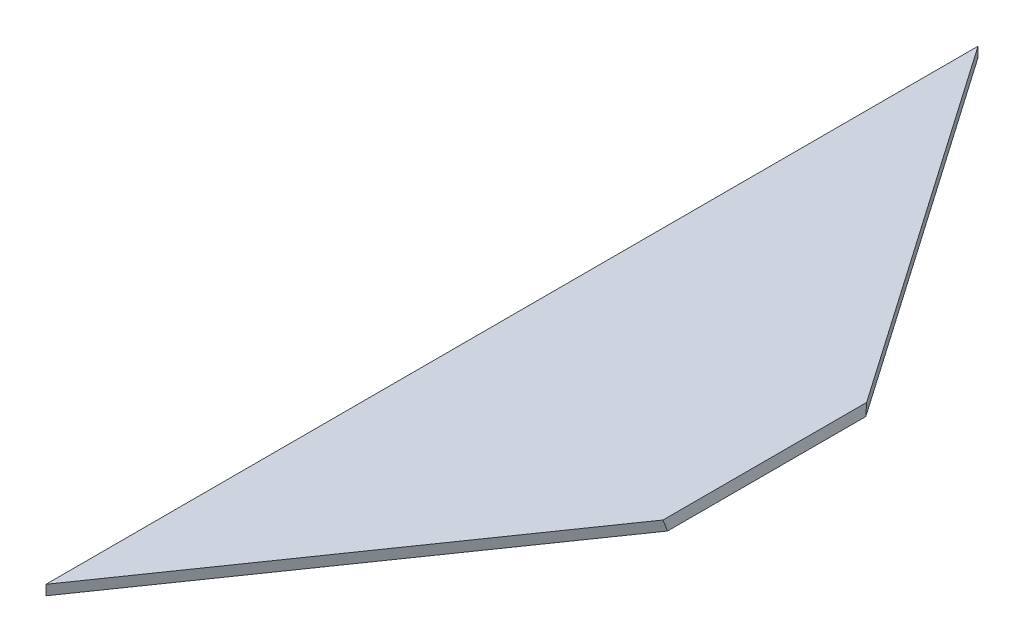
ISO-10303-21;
HEADER;
FILE_DESCRIPTION(('STEP AP214'),'2;1');
FILE_NAME('part.step','',(''),(''),'','','');
FILE_SCHEMA(('AUTOMOTIVE_DESIGN { 1 0 10303 214 1 1 1 1 }'));
ENDSEC;
DATA;
#1=APPLICATION_CONTEXT('core data for automotive mechanical design processes');
#2=APPLICATION_PROTOCOL_DEFINITION('international standard','automotive_design',2000,#1);
#3=PRODUCT_CONTEXT('',#1,'mechanical');
#4=PRODUCT('Part','Part','',(#3));
#5=PRODUCT_RELATED_PRODUCT_CATEGORY('part','',(#4));
#6=PRODUCT_DEFINITION_FORMATION('','',#4);
#7=PRODUCT_DEFINITION_CONTEXT('part definition',#1,'design');
#8=PRODUCT_DEFINITION('design','',#6,#7);
#9=PRODUCT_DEFINITION_SHAPE('','',#8);
#10=(LENGTH_UNIT() NAMED_UNIT(*) SI_UNIT(.MILLI.,.METRE.));
#11=(NAMED_UNIT(*) PLANE_ANGLE_UNIT() SI_UNIT($,.RADIAN.));
#12=(NAMED_UNIT(*) SI_UNIT($,.STERADIAN.) SOLID_ANGLE_UNIT());
#13=UNCERTAINTY_MEASURE_WITH_UNIT(LENGTH_MEASURE(1.E-05),#10,'distance_accuracy_value','');
#14=(GEOMETRIC_REPRESENTATION_CONTEXT(3) GLOBAL_UNCERTAINTY_ASSIGNED_CONTEXT((#13)) GLOBAL_UNIT_ASSIGNED_CONTEXT((#10,
#11,#12)) REPRESENTATION_CONTEXT('',''));
#15=CARTESIAN_POINT('',(0.,0.,0.));
#16=DIRECTION('',(0.,0.,1.));
#17=DIRECTION('',(1.,0.,0.));
#18=AXIS2_PLACEMENT_3D('',#15,#16,#17);
#19=CARTESIAN_POINT('',(87.1939278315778,3.,14.8347995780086));
#20=DIRECTION('',(-0.821469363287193,0.,-0.570252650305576));
#21=DIRECTION('',(-0.570252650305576,0.,0.821469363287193));
#22=AXIS2_PLACEMENT_3D('',#19,#20,#21);
#23=PLANE('',#22);
#24=DIRECTION('',(0.177658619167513,-0.950231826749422,-0.255923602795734));
#25=VECTOR('',#24,1.);
#26=CARTESIAN_POINT('',(77.3207050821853,-2.67650494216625,29.0575305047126));
#27=LINE('',#26,#25);
#28=CARTESIAN_POINT('',(76.2594061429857,3.,30.5863696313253));
#29=VERTEX_POINT('',#28);
#30=CARTESIAN_POINT('',(76.820296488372,0.,29.7783870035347));
#31=VERTEX_POINT('',#30);
#32=EDGE_CURVE('E71',#29,#31,#27,.T.);
#33=ORIENTED_EDGE('',*,*,#32,.F.);
#34=DIRECTION('',(0.570252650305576,0.,-0.821469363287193));
#35=VECTOR('',#34,1.);
#36=CARTESIAN_POINT('',(87.1939278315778,3.,14.8347995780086));
#37=LINE('',#36,#35);
#38=CARTESIAN_POINT('',(0.305979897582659,3.,140.000000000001));
#39=VERTEX_POINT('',#38);
#40=EDGE_CURVE('E85',#39,#29,#37,.T.);
#41=ORIENTED_EDGE('',*,*,#40,.F.);
#42=DIRECTION('',(0.,-1.,0.));
#43=VECTOR('',#42,1.);
#44=CARTESIAN_POINT('',(0.305979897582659,3.,140.000000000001));
#45=LINE('',#44,#43);
#46=CARTESIAN_POINT('',(0.305979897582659,0.,140.000000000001));
#47=VERTEX_POINT('',#46);
#48=EDGE_CURVE('E42',#39,#47,#45,.T.);
#49=ORIENTED_EDGE('',*,*,#48,.T.);
#50=DIRECTION('',(0.570252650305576,0.,-0.821469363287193));
#51=VECTOR('',#50,1.);
#52=CARTESIAN_POINT('',(87.1939278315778,0.,14.8347995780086));
#53=LINE('',#52,#51);
#54=EDGE_CURVE('E62',#47,#31,#53,.T.);
#55=ORIENTED_EDGE('',*,*,#54,.T.);
#56=EDGE_LOOP('',(#33,#41,#49,#55));
#57=FACE_BOUND('',#56,.T.);
#58=ADVANCED_FACE('F33',(#57),#23,.F.);
#59=CARTESIAN_POINT('',(0.305979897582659,3.,-140.000000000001));
#60=DIRECTION('',(-0.821469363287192,0.,0.570252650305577));
#61=DIRECTION('',(0.570252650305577,0.,0.821469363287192));
#62=AXIS2_PLACEMENT_3D('',#59,#60,#61);
#63=PLANE('',#62);
#64=DIRECTION('',(-0.177658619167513,0.950231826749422,-0.255923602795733));
#65=VECTOR('',#64,1.);
#66=CARTESIAN_POINT('',(68.8874064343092,42.4301654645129,-41.2059992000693));
#67=LINE('',#66,#65);
#68=CARTESIAN_POINT('',(76.8202964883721,0.,-29.7783870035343));
#69=VERTEX_POINT('',#68);
#70=CARTESIAN_POINT('',(76.2594061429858,3.,-30.5863696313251));
#71=VERTEX_POINT('',#70);
#72=EDGE_CURVE('E11',#69,#71,#67,.T.);
#73=ORIENTED_EDGE('',*,*,#72,.F.);
#74=DIRECTION('',(-0.570252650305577,0.,-0.821469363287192));
#75=VECTOR('',#74,1.);
#76=CARTESIAN_POINT('',(0.305979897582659,0.,-140.000000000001));
#77=LINE('',#76,#75);
#78=CARTESIAN_POINT('',(0.305979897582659,0.,-140.000000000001));
#79=VERTEX_POINT('',#78);
#80=EDGE_CURVE('E101',#69,#79,#77,.T.);
#81=ORIENTED_EDGE('',*,*,#80,.T.);
#82=DIRECTION('',(0.,-1.,0.));
#83=VECTOR('',#82,1.);
#84=CARTESIAN_POINT('',(0.305979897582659,3.,-140.000000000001));
#85=LINE('',#84,#83);
#86=CARTESIAN_POINT('',(0.305979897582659,3.,-140.000000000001));
#87=VERTEX_POINT('',#86);
#88=EDGE_CURVE('E89',#87,#79,#85,.T.);
#89=ORIENTED_EDGE('',*,*,#88,.F.);
#90=DIRECTION('',(-0.570252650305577,0.,-0.821469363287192));
#91=VECTOR('',#90,1.);
#92=CARTESIAN_POINT('',(0.305979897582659,3.,-140.000000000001));
#93=LINE('',#92,#91);
#94=EDGE_CURVE('E50',#71,#87,#93,.T.);
#95=ORIENTED_EDGE('',*,*,#94,.F.);
#96=EDGE_LOOP('',(#73,#81,#89,#95));
#97=FACE_BOUND('',#96,.T.);
#98=ADVANCED_FACE('F87',(#97),#63,.F.);
#99=CARTESIAN_POINT('',(0.305979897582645,3.,140.000000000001));
#100=DIRECTION('',(0.,-1.,0.));
#101=DIRECTION('',(0.,0.,-1.));
#102=AXIS2_PLACEMENT_3D('',#99,#100,#101);
#103=PLANE('',#102);
#104=DIRECTION('',(0.,0.,1.));
#105=VECTOR('',#104,1.);
#106=CARTESIAN_POINT('',(76.2594061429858,3.,140.000000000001));
#107=LINE('',#106,#105);
#108=EDGE_CURVE('E79',#71,#29,#107,.T.);
#109=ORIENTED_EDGE('',*,*,#108,.F.);
#110=ORIENTED_EDGE('',*,*,#94,.T.);
#111=DIRECTION('',(0.,0.,1.));
#112=VECTOR('',#111,1.);
#113=CARTESIAN_POINT('',(0.305979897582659,3.,-140.000000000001));
#114=LINE('',#113,#112);
#115=EDGE_CURVE('E93',#87,#39,#114,.T.);
#116=ORIENTED_EDGE('',*,*,#115,.T.);
#117=ORIENTED_EDGE('',*,*,#40,.T.);
#118=EDGE_LOOP('',(#109,#110,#116,#117));
#119=FACE_BOUND('',#118,.T.);
#120=ADVANCED_FACE('F84',(#119),#103,.F.);
#121=CARTESIAN_POINT('',(0.305979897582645,0.,140.000000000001));
#122=DIRECTION('',(0.,-1.,0.));
#123=DIRECTION('',(0.,0.,-1.));
#124=AXIS2_PLACEMENT_3D('',#121,#122,#123);
#125=PLANE('',#124);
#126=ORIENTED_EDGE('',*,*,#80,.F.);
#127=DIRECTION('',(0.,0.,1.));
#128=VECTOR('',#127,1.);
#129=CARTESIAN_POINT('',(76.8202964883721,0.,140.000000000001));
#130=LINE('',#129,#128);
#131=EDGE_CURVE('E81',#69,#31,#130,.T.);
#132=ORIENTED_EDGE('',*,*,#131,.T.);
#133=ORIENTED_EDGE('',*,*,#54,.F.);
#134=DIRECTION('',(0.,0.,1.));
#135=VECTOR('',#134,1.);
#136=CARTESIAN_POINT('',(0.305979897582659,0.,-140.000000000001));
#137=LINE('',#136,#135);
#138=EDGE_CURVE('E97',#79,#47,#137,.T.);
#139=ORIENTED_EDGE('',*,*,#138,.F.);
#140=EDGE_LOOP('',(#126,#132,#133,#139));
#141=FACE_BOUND('',#140,.T.);
#142=ADVANCED_FACE('F105',(#141),#125,.T.);
#143=CARTESIAN_POINT('',(0.305979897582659,3.,-140.000000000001));
#144=DIRECTION('',(1.,0.,0.));
#145=DIRECTION('',(0.,0.,-1.));
#146=AXIS2_PLACEMENT_3D('',#143,#144,#145);
#147=PLANE('',#146);
#148=ORIENTED_EDGE('',*,*,#138,.T.);
#149=ORIENTED_EDGE('',*,*,#48,.F.);
#150=ORIENTED_EDGE('',*,*,#115,.F.);
#151=ORIENTED_EDGE('',*,*,#88,.T.);
#152=EDGE_LOOP('',(#148,#149,#150,#151));
#153=FACE_BOUND('',#152,.T.);
#154=ADVANCED_FACE('F35',(#153),#147,.F.);
#155=CARTESIAN_POINT('',(76.2614928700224,2.98883885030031,30.686564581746));
#156=DIRECTION('',(0.98296758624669,0.183779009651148,0.));
#157=DIRECTION('',(0.,0.,-1.));
#158=AXIS2_PLACEMENT_3D('',#155,#156,#157);
#159=PLANE('',#158);
#160=ORIENTED_EDGE('',*,*,#32,.T.);
#161=ORIENTED_EDGE('',*,*,#131,.F.);
#162=ORIENTED_EDGE('',*,*,#72,.T.);
#163=ORIENTED_EDGE('',*,*,#108,.T.);
#164=EDGE_LOOP('',(#160,#161,#162,#163));
#165=FACE_BOUND('',#164,.T.);
#166=ADVANCED_FACE('F78',(#165),#159,.T.);
#167=CLOSED_SHELL('',(#58,#98,#120,#142,#154,#166));
#168=MANIFOLD_SOLID_BREP('B2',#167);
#169=ADVANCED_BREP_SHAPE_REPRESENTATION('',(#18,#168),#14);
#170=SHAPE_DEFINITION_REPRESENTATION(#9,#169);
ENDSEC;
END-ISO-10303-21;
